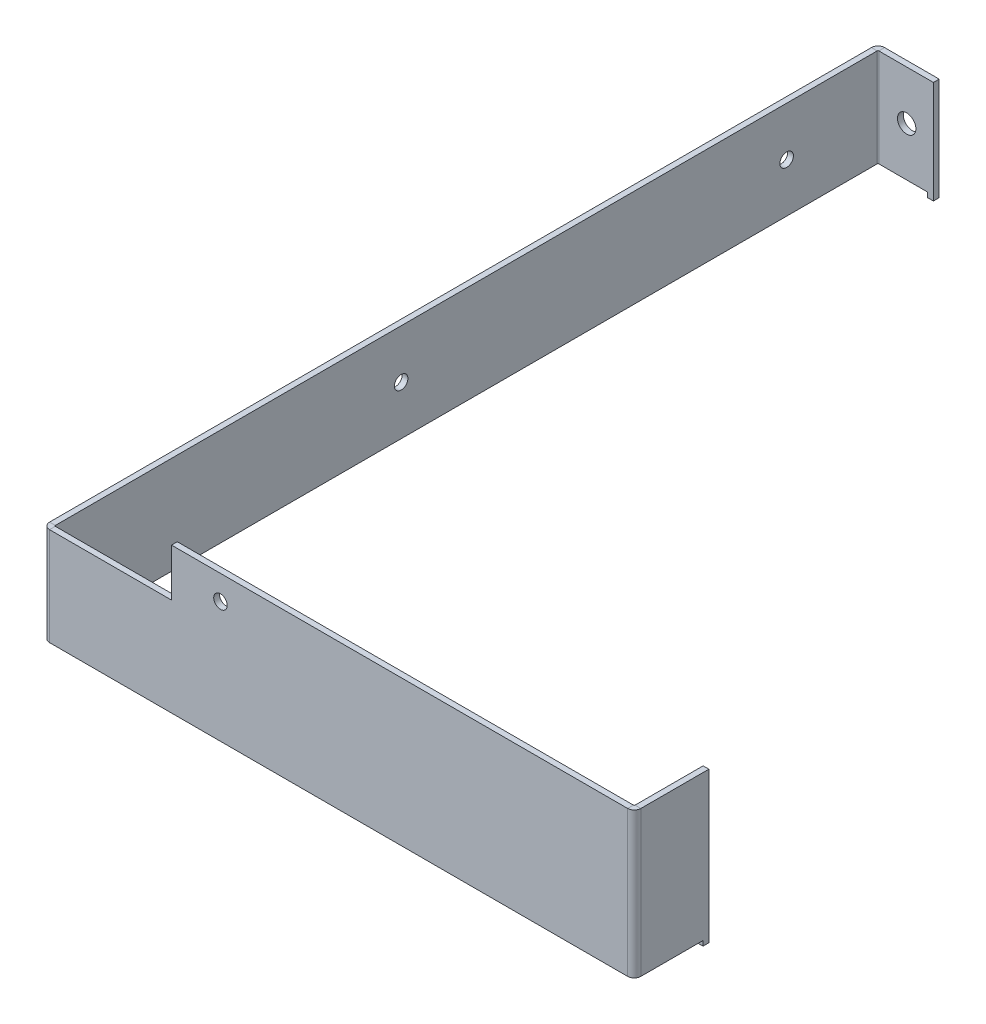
ISO-10303-21;
HEADER;
FILE_DESCRIPTION(('STEP AP214'),'2;1');
FILE_NAME('part.step','',(''),(''),'','','');
FILE_SCHEMA(('AUTOMOTIVE_DESIGN { 1 0 10303 214 1 1 1 1 }'));
ENDSEC;
DATA;
#1=APPLICATION_CONTEXT('core data for automotive mechanical design processes');
#2=APPLICATION_PROTOCOL_DEFINITION('international standard','automotive_design',2000,#1);
#3=PRODUCT_CONTEXT('',#1,'mechanical');
#4=PRODUCT('Part','Part','',(#3));
#5=PRODUCT_RELATED_PRODUCT_CATEGORY('part','',(#4));
#6=PRODUCT_DEFINITION_FORMATION('','',#4);
#7=PRODUCT_DEFINITION_CONTEXT('part definition',#1,'design');
#8=PRODUCT_DEFINITION('design','',#6,#7);
#9=PRODUCT_DEFINITION_SHAPE('','',#8);
#10=(LENGTH_UNIT() NAMED_UNIT(*) SI_UNIT(.MILLI.,.METRE.));
#11=(NAMED_UNIT(*) PLANE_ANGLE_UNIT() SI_UNIT($,.RADIAN.));
#12=(NAMED_UNIT(*) SI_UNIT($,.STERADIAN.) SOLID_ANGLE_UNIT());
#13=UNCERTAINTY_MEASURE_WITH_UNIT(LENGTH_MEASURE(1.E-05),#10,'distance_accuracy_value','');
#14=(GEOMETRIC_REPRESENTATION_CONTEXT(3) GLOBAL_UNCERTAINTY_ASSIGNED_CONTEXT((#13)) GLOBAL_UNIT_ASSIGNED_CONTEXT((#10,
#11,#12)) REPRESENTATION_CONTEXT('',''));
#15=CARTESIAN_POINT('',(0.,0.,0.));
#16=DIRECTION('',(0.,0.,1.));
#17=DIRECTION('',(1.,0.,0.));
#18=AXIS2_PLACEMENT_3D('',#15,#16,#17);
#19=CARTESIAN_POINT('',(-15.8764,0.,-15.0396));
#20=DIRECTION('',(-1.,0.,0.));
#21=DIRECTION('',(0.,0.,1.));
#22=AXIS2_PLACEMENT_3D('',#19,#20,#21);
#23=PLANE('',#22);
#24=CARTESIAN_POINT('',(-15.8763999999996,27.94,123.7841));
#25=DIRECTION('',(1.,0.,0.));
#26=DIRECTION('',(0.,0.,-1.));
#27=AXIS2_PLACEMENT_3D('',#24,#25,#26);
#28=CIRCLE('',#27,1.7526);
#29=CARTESIAN_POINT('',(-15.8763999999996,27.94,122.0315));
#30=VERTEX_POINT('',#29);
#31=EDGE_CURVE('E257',#30,#30,#28,.T.);
#32=ORIENTED_EDGE('',*,*,#31,.T.);
#33=EDGE_LOOP('',(#32));
#34=FACE_BOUND('',#33,.T.);
#35=CARTESIAN_POINT('',(-15.8763999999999,27.94,23.7080999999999));
#36=DIRECTION('',(1.,0.,0.));
#37=DIRECTION('',(0.,0.,-1.));
#38=AXIS2_PLACEMENT_3D('',#35,#36,#37);
#39=CIRCLE('',#38,1.75259999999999);
#40=CARTESIAN_POINT('',(-15.8763999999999,27.94,21.9555));
#41=VERTEX_POINT('',#40);
#42=EDGE_CURVE('E261',#41,#41,#39,.T.);
#43=ORIENTED_EDGE('',*,*,#42,.T.);
#44=EDGE_LOOP('',(#43));
#45=FACE_BOUND('',#44,.T.);
#46=DIRECTION('',(0.,0.,1.));
#47=VECTOR('',#46,1.);
#48=CARTESIAN_POINT('',(-15.8763999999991,40.64,246.301));
#49=LINE('',#48,#47);
#50=CARTESIAN_POINT('',(-15.8764,40.64,0.203199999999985));
#51=VERTEX_POINT('',#50);
#52=CARTESIAN_POINT('',(-15.8763999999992,40.64,213.5618));
#53=VERTEX_POINT('',#52);
#54=EDGE_CURVE('E260',#51,#53,#49,.T.);
#55=ORIENTED_EDGE('',*,*,#54,.F.);
#56=DIRECTION('',(0.,-1.,0.));
#57=VECTOR('',#56,1.);
#58=CARTESIAN_POINT('',(-15.8764,0.,0.203200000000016));
#59=LINE('',#58,#57);
#60=CARTESIAN_POINT('',(-15.8764,15.24,0.203200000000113));
#61=VERTEX_POINT('',#60);
#62=EDGE_CURVE('E371',#51,#61,#59,.T.);
#63=ORIENTED_EDGE('',*,*,#62,.T.);
#64=DIRECTION('',(0.,0.,1.));
#65=VECTOR('',#64,1.);
#66=CARTESIAN_POINT('',(-15.8763999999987,15.24,381.937));
#67=LINE('',#66,#65);
#68=CARTESIAN_POINT('',(-15.8763999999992,15.24,213.5618));
#69=VERTEX_POINT('',#68);
#70=EDGE_CURVE('E264',#61,#69,#67,.T.);
#71=ORIENTED_EDGE('',*,*,#70,.T.);
#72=DIRECTION('',(0.,-1.,0.));
#73=VECTOR('',#72,1.);
#74=CARTESIAN_POINT('',(-15.8763999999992,0.,213.5618));
#75=LINE('',#74,#73);
#76=EDGE_CURVE('E241',#53,#69,#75,.T.);
#77=ORIENTED_EDGE('',*,*,#76,.F.);
#78=EDGE_LOOP('',(#55,#63,#71,#77));
#79=FACE_BOUND('',#78,.T.);
#80=ADVANCED_FACE('F50',(#34,#45,#79),#23,.T.);
#81=CARTESIAN_POINT('',(-15.8763999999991,40.64,246.301));
#82=DIRECTION('',(0.,1.,0.));
#83=DIRECTION('',(1.,0.,0.));
#84=AXIS2_PLACEMENT_3D('',#81,#82,#83);
#85=PLANE('',#84);
#86=DIRECTION('',(0.,0.,1.));
#87=VECTOR('',#86,1.);
#88=CARTESIAN_POINT('',(-14.3763999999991,40.64,246.301));
#89=LINE('',#88,#87);
#90=CARTESIAN_POINT('',(-14.3764,40.64,0.203200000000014));
#91=VERTEX_POINT('',#90);
#92=CARTESIAN_POINT('',(-14.3763999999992,40.64,213.5618));
#93=VERTEX_POINT('',#92);
#94=EDGE_CURVE('E256',#91,#93,#89,.T.);
#95=ORIENTED_EDGE('',*,*,#94,.F.);
#96=DIRECTION('',(-1.,0.,0.));
#97=VECTOR('',#96,1.);
#98=CARTESIAN_POINT('',(-15.8764,40.64,0.203200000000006));
#99=LINE('',#98,#97);
#100=EDGE_CURVE('E378',#91,#51,#99,.T.);
#101=ORIENTED_EDGE('',*,*,#100,.T.);
#102=ORIENTED_EDGE('',*,*,#54,.T.);
#103=DIRECTION('',(-1.,0.,0.));
#104=VECTOR('',#103,1.);
#105=CARTESIAN_POINT('',(-15.8763999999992,40.64,213.5618));
#106=LINE('',#105,#104);
#107=EDGE_CURVE('E271',#93,#53,#106,.T.);
#108=ORIENTED_EDGE('',*,*,#107,.F.);
#109=EDGE_LOOP('',(#95,#101,#102,#108));
#110=FACE_BOUND('',#109,.T.);
#111=ADVANCED_FACE('F481',(#110),#85,.T.);
#112=CARTESIAN_POINT('',(-14.3764,0.,-15.0396));
#113=DIRECTION('',(-1.,0.,0.));
#114=DIRECTION('',(0.,0.,1.));
#115=AXIS2_PLACEMENT_3D('',#112,#113,#114);
#116=PLANE('',#115);
#117=DIRECTION('',(0.,-1.,0.));
#118=VECTOR('',#117,1.);
#119=CARTESIAN_POINT('',(-14.3764,0.,0.203200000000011));
#120=LINE('',#119,#118);
#121=CARTESIAN_POINT('',(-14.3764,15.24,0.203200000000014));
#122=VERTEX_POINT('',#121);
#123=EDGE_CURVE('E381',#91,#122,#120,.T.);
#124=ORIENTED_EDGE('',*,*,#123,.F.);
#125=ORIENTED_EDGE('',*,*,#94,.T.);
#126=DIRECTION('',(0.,-1.,0.));
#127=VECTOR('',#126,1.);
#128=CARTESIAN_POINT('',(-14.3763999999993,0.,213.5618));
#129=LINE('',#128,#127);
#130=CARTESIAN_POINT('',(-14.3763999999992,15.24,213.5618));
#131=VERTEX_POINT('',#130);
#132=EDGE_CURVE('E253',#93,#131,#129,.T.);
#133=ORIENTED_EDGE('',*,*,#132,.T.);
#134=DIRECTION('',(0.,0.,1.));
#135=VECTOR('',#134,1.);
#136=CARTESIAN_POINT('',(-14.3763999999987,15.24,381.937));
#137=LINE('',#136,#135);
#138=EDGE_CURVE('E252',#122,#131,#137,.T.);
#139=ORIENTED_EDGE('',*,*,#138,.F.);
#140=EDGE_LOOP('',(#124,#125,#133,#139));
#141=FACE_BOUND('',#140,.T.);
#142=CARTESIAN_POINT('',(-14.3763999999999,27.94,23.7080999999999));
#143=DIRECTION('',(1.,0.,0.));
#144=DIRECTION('',(0.,0.,-1.));
#145=AXIS2_PLACEMENT_3D('',#142,#143,#144);
#146=CIRCLE('',#145,1.75259999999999);
#147=CARTESIAN_POINT('',(-14.3763999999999,27.94,21.9555));
#148=VERTEX_POINT('',#147);
#149=EDGE_CURVE('E265',#148,#148,#146,.T.);
#150=ORIENTED_EDGE('',*,*,#149,.F.);
#151=EDGE_LOOP('',(#150));
#152=FACE_BOUND('',#151,.T.);
#153=CARTESIAN_POINT('',(-14.3763999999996,27.94,123.7841));
#154=DIRECTION('',(1.,0.,0.));
#155=DIRECTION('',(0.,0.,-1.));
#156=AXIS2_PLACEMENT_3D('',#153,#154,#155);
#157=CIRCLE('',#156,1.7526);
#158=CARTESIAN_POINT('',(-14.3763999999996,27.94,122.0315));
#159=VERTEX_POINT('',#158);
#160=EDGE_CURVE('E268',#159,#159,#157,.T.);
#161=ORIENTED_EDGE('',*,*,#160,.F.);
#162=EDGE_LOOP('',(#161));
#163=FACE_BOUND('',#162,.T.);
#164=ADVANCED_FACE('F476',(#141,#152,#163),#116,.F.);
#165=CARTESIAN_POINT('',(17.4964000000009,40.64,215.265));
#166=DIRECTION('',(0.,1.,0.));
#167=DIRECTION('',(0.,0.,-1.));
#168=AXIS2_PLACEMENT_3D('',#165,#166,#167);
#169=PLANE('',#168);
#170=DIRECTION('',(1.,0.,0.));
#171=VECTOR('',#170,1.);
#172=CARTESIAN_POINT('',(17.4964000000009,40.64,213.765));
#173=LINE('',#172,#171);
#174=CARTESIAN_POINT('',(-14.1731999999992,40.64,213.765));
#175=VERTEX_POINT('',#174);
#176=CARTESIAN_POINT('',(17.4964000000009,40.64,213.765));
#177=VERTEX_POINT('',#176);
#178=EDGE_CURVE('E295',#175,#177,#173,.T.);
#179=ORIENTED_EDGE('',*,*,#178,.F.);
#180=DIRECTION('',(0.,0.,1.));
#181=VECTOR('',#180,1.);
#182=CARTESIAN_POINT('',(-14.1731999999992,40.64,215.265));
#183=LINE('',#182,#181);
#184=CARTESIAN_POINT('',(-14.1731999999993,40.64,215.265));
#185=VERTEX_POINT('',#184);
#186=EDGE_CURVE('E363',#175,#185,#183,.T.);
#187=ORIENTED_EDGE('',*,*,#186,.T.);
#188=DIRECTION('',(1.,0.,0.));
#189=VECTOR('',#188,1.);
#190=CARTESIAN_POINT('',(17.4964000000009,40.64,215.265));
#191=LINE('',#190,#189);
#192=CARTESIAN_POINT('',(17.4964000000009,40.64,215.265));
#193=VERTEX_POINT('',#192);
#194=EDGE_CURVE('E315',#185,#193,#191,.T.);
#195=ORIENTED_EDGE('',*,*,#194,.T.);
#196=DIRECTION('',(0.,0.,-1.));
#197=VECTOR('',#196,1.);
#198=CARTESIAN_POINT('',(17.4964000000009,40.64,215.265));
#199=LINE('',#198,#197);
#200=EDGE_CURVE('E312',#193,#177,#199,.T.);
#201=ORIENTED_EDGE('',*,*,#200,.T.);
#202=EDGE_LOOP('',(#179,#187,#195,#201));
#203=FACE_BOUND('',#202,.T.);
#204=ADVANCED_FACE('F467',(#203),#169,.T.);
#205=CARTESIAN_POINT('',(-243.844199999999,0.,215.265000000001));
#206=DIRECTION('',(0.,0.,1.));
#207=DIRECTION('',(1.,0.,0.));
#208=AXIS2_PLACEMENT_3D('',#205,#206,#207);
#209=PLANE('',#208);
#210=CARTESIAN_POINT('',(30.1964000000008,46.6535349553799,215.265));
#211=DIRECTION('',(0.,0.,-1.));
#212=DIRECTION('',(-1.,0.,0.));
#213=AXIS2_PLACEMENT_3D('',#210,#211,#212);
#214=CIRCLE('',#213,1.75259999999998);
#215=CARTESIAN_POINT('',(28.4438000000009,46.6535349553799,215.265));
#216=VERTEX_POINT('',#215);
#217=EDGE_CURVE('E303',#216,#216,#214,.T.);
#218=ORIENTED_EDGE('',*,*,#217,.T.);
#219=EDGE_LOOP('',(#218));
#220=FACE_BOUND('',#219,.T.);
#221=ORIENTED_EDGE('',*,*,#194,.F.);
#222=DIRECTION('',(0.,-1.,0.));
#223=VECTOR('',#222,1.);
#224=CARTESIAN_POINT('',(-14.1731999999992,0.,215.265));
#225=LINE('',#224,#223);
#226=CARTESIAN_POINT('',(-14.1731999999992,15.24,215.265));
#227=VERTEX_POINT('',#226);
#228=EDGE_CURVE('E356',#185,#227,#225,.T.);
#229=ORIENTED_EDGE('',*,*,#228,.T.);
#230=DIRECTION('',(1.,0.,0.));
#231=VECTOR('',#230,1.);
#232=CARTESIAN_POINT('',(153.132400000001,15.24,215.264999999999));
#233=LINE('',#232,#231);
#234=CARTESIAN_POINT('',(135.911200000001,15.24,215.264999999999));
#235=VERTEX_POINT('',#234);
#236=EDGE_CURVE('E306',#227,#235,#233,.T.);
#237=ORIENTED_EDGE('',*,*,#236,.T.);
#238=DIRECTION('',(0.,-1.,0.));
#239=VECTOR('',#238,1.);
#240=CARTESIAN_POINT('',(135.911200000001,0.,215.264999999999));
#241=LINE('',#240,#239);
#242=CARTESIAN_POINT('',(135.911200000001,53.0035349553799,215.264999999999));
#243=VERTEX_POINT('',#242);
#244=EDGE_CURVE('E282',#243,#235,#241,.T.);
#245=ORIENTED_EDGE('',*,*,#244,.F.);
#246=DIRECTION('',(1.,0.,0.));
#247=VECTOR('',#246,1.);
#248=CARTESIAN_POINT('',(17.4964000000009,53.00353495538,215.265));
#249=LINE('',#248,#247);
#250=CARTESIAN_POINT('',(17.4964000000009,53.00353495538,215.265));
#251=VERTEX_POINT('',#250);
#252=EDGE_CURVE('E301',#251,#243,#249,.T.);
#253=ORIENTED_EDGE('',*,*,#252,.F.);
#254=DIRECTION('',(0.,1.,0.));
#255=VECTOR('',#254,1.);
#256=CARTESIAN_POINT('',(17.4964000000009,40.64,215.265));
#257=LINE('',#256,#255);
#258=EDGE_CURVE('E309',#193,#251,#257,.T.);
#259=ORIENTED_EDGE('',*,*,#258,.F.);
#260=EDGE_LOOP('',(#221,#229,#237,#245,#253,#259));
#261=FACE_BOUND('',#260,.T.);
#262=ADVANCED_FACE('F408',(#220,#261),#209,.T.);
#263=CARTESIAN_POINT('',(-243.844199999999,0.,213.765000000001));
#264=DIRECTION('',(0.,0.,1.));
#265=DIRECTION('',(1.,0.,0.));
#266=AXIS2_PLACEMENT_3D('',#263,#264,#265);
#267=PLANE('',#266);
#268=DIRECTION('',(0.,-1.,0.));
#269=VECTOR('',#268,1.);
#270=CARTESIAN_POINT('',(-14.1731999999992,0.,213.765));
#271=LINE('',#270,#269);
#272=CARTESIAN_POINT('',(-14.1731999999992,15.24,213.765));
#273=VERTEX_POINT('',#272);
#274=EDGE_CURVE('E366',#175,#273,#271,.T.);
#275=ORIENTED_EDGE('',*,*,#274,.F.);
#276=ORIENTED_EDGE('',*,*,#178,.T.);
#277=DIRECTION('',(0.,1.,0.));
#278=VECTOR('',#277,1.);
#279=CARTESIAN_POINT('',(17.4964000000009,40.64,213.765));
#280=LINE('',#279,#278);
#281=CARTESIAN_POINT('',(17.4964000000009,53.00353495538,213.765));
#282=VERTEX_POINT('',#281);
#283=EDGE_CURVE('E292',#177,#282,#280,.T.);
#284=ORIENTED_EDGE('',*,*,#283,.T.);
#285=DIRECTION('',(1.,0.,0.));
#286=VECTOR('',#285,1.);
#287=CARTESIAN_POINT('',(17.4964000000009,53.00353495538,213.765));
#288=LINE('',#287,#286);
#289=CARTESIAN_POINT('',(135.911200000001,53.0035349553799,213.764999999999));
#290=VERTEX_POINT('',#289);
#291=EDGE_CURVE('E299',#282,#290,#288,.T.);
#292=ORIENTED_EDGE('',*,*,#291,.T.);
#293=DIRECTION('',(0.,-1.,0.));
#294=VECTOR('',#293,1.);
#295=CARTESIAN_POINT('',(135.911200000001,0.,213.764999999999));
#296=LINE('',#295,#294);
#297=CARTESIAN_POINT('',(135.911200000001,15.24,213.764999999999));
#298=VERTEX_POINT('',#297);
#299=EDGE_CURVE('E296',#290,#298,#296,.T.);
#300=ORIENTED_EDGE('',*,*,#299,.T.);
#301=DIRECTION('',(1.,0.,0.));
#302=VECTOR('',#301,1.);
#303=CARTESIAN_POINT('',(153.132400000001,15.24,213.764999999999));
#304=LINE('',#303,#302);
#305=EDGE_CURVE('E291',#273,#298,#304,.T.);
#306=ORIENTED_EDGE('',*,*,#305,.F.);
#307=EDGE_LOOP('',(#275,#276,#284,#292,#300,#306));
#308=FACE_BOUND('',#307,.T.);
#309=CARTESIAN_POINT('',(30.1964000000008,46.6535349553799,213.765));
#310=DIRECTION('',(0.,0.,-1.));
#311=DIRECTION('',(-1.,0.,0.));
#312=AXIS2_PLACEMENT_3D('',#309,#310,#311);
#313=CIRCLE('',#312,1.75259999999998);
#314=CARTESIAN_POINT('',(28.4438000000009,46.6535349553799,213.765));
#315=VERTEX_POINT('',#314);
#316=EDGE_CURVE('E316',#315,#315,#313,.T.);
#317=ORIENTED_EDGE('',*,*,#316,.F.);
#318=EDGE_LOOP('',(#317));
#319=FACE_BOUND('',#318,.T.);
#320=ADVANCED_FACE('F455',(#308,#319),#267,.F.);
#321=CARTESIAN_POINT('',(137.614400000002,53.0035349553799,333.046199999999));
#322=DIRECTION('',(0.,1.,0.));
#323=DIRECTION('',(-1.,0.,0.));
#324=AXIS2_PLACEMENT_3D('',#321,#322,#323);
#325=PLANE('',#324);
#326=DIRECTION('',(0.,0.,-1.));
#327=VECTOR('',#326,1.);
#328=CARTESIAN_POINT('',(136.114400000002,53.0035349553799,333.046199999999));
#329=LINE('',#328,#327);
#330=CARTESIAN_POINT('',(136.114400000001,53.0035349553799,213.561799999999));
#331=VERTEX_POINT('',#330);
#332=CARTESIAN_POINT('',(136.114400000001,53.00353495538,195.886199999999));
#333=VERTEX_POINT('',#332);
#334=EDGE_CURVE('E334',#331,#333,#329,.T.);
#335=ORIENTED_EDGE('',*,*,#334,.F.);
#336=DIRECTION('',(1.,0.,0.));
#337=VECTOR('',#336,1.);
#338=CARTESIAN_POINT('',(137.614400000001,53.0035349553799,213.561799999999));
#339=LINE('',#338,#337);
#340=CARTESIAN_POINT('',(137.614400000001,53.0035349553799,213.561799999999));
#341=VERTEX_POINT('',#340);
#342=EDGE_CURVE('E348',#331,#341,#339,.T.);
#343=ORIENTED_EDGE('',*,*,#342,.T.);
#344=DIRECTION('',(0.,0.,-1.));
#345=VECTOR('',#344,1.);
#346=CARTESIAN_POINT('',(137.614400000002,53.0035349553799,333.046199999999));
#347=LINE('',#346,#345);
#348=CARTESIAN_POINT('',(137.614400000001,53.00353495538,195.886199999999));
#349=VERTEX_POINT('',#348);
#350=EDGE_CURVE('E339',#341,#349,#347,.T.);
#351=ORIENTED_EDGE('',*,*,#350,.T.);
#352=DIRECTION('',(-1.,0.,0.));
#353=VECTOR('',#352,1.);
#354=CARTESIAN_POINT('',(137.614400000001,53.00353495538,195.886199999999));
#355=LINE('',#354,#353);
#356=EDGE_CURVE('E338',#349,#333,#355,.T.);
#357=ORIENTED_EDGE('',*,*,#356,.T.);
#358=EDGE_LOOP('',(#335,#343,#351,#357));
#359=FACE_BOUND('',#358,.T.);
#360=ADVANCED_FACE('F445',(#359),#325,.T.);
#361=CARTESIAN_POINT('',(137.614400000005,-1.30004753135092E-13,594.386799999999));
#362=DIRECTION('',(1.,0.,0.));
#363=DIRECTION('',(0.,0.,-1.));
#364=AXIS2_PLACEMENT_3D('',#361,#362,#363);
#365=PLANE('',#364);
#366=DIRECTION('',(0.,0.,1.));
#367=VECTOR('',#366,1.);
#368=CARTESIAN_POINT('',(137.614400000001,13.9699999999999,-1.5));
#369=LINE('',#368,#367);
#370=CARTESIAN_POINT('',(137.614400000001,13.9699999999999,195.886199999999));
#371=VERTEX_POINT('',#370);
#372=CARTESIAN_POINT('',(137.614400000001,13.9699999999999,197.410199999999));
#373=VERTEX_POINT('',#372);
#374=EDGE_CURVE('E65',#371,#373,#369,.T.);
#375=ORIENTED_EDGE('',*,*,#374,.F.);
#376=DIRECTION('',(0.,-1.,0.));
#377=VECTOR('',#376,1.);
#378=CARTESIAN_POINT('',(137.614400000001,-53.0035349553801,195.886199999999));
#379=LINE('',#378,#377);
#380=EDGE_CURVE('E335',#349,#371,#379,.T.);
#381=ORIENTED_EDGE('',*,*,#380,.F.);
#382=ORIENTED_EDGE('',*,*,#350,.F.);
#383=DIRECTION('',(0.,-1.,0.));
#384=VECTOR('',#383,1.);
#385=CARTESIAN_POINT('',(137.614400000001,0.,213.561799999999));
#386=LINE('',#385,#384);
#387=CARTESIAN_POINT('',(137.614400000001,15.24,213.561799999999));
#388=VERTEX_POINT('',#387);
#389=EDGE_CURVE('E345',#341,#388,#386,.T.);
#390=ORIENTED_EDGE('',*,*,#389,.T.);
#391=DIRECTION('',(0.,0.,-1.));
#392=VECTOR('',#391,1.);
#393=CARTESIAN_POINT('',(137.614400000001,15.24,197.410199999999));
#394=LINE('',#393,#392);
#395=CARTESIAN_POINT('',(137.614400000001,15.24,197.410199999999));
#396=VERTEX_POINT('',#395);
#397=EDGE_CURVE('E327',#388,#396,#394,.T.);
#398=ORIENTED_EDGE('',*,*,#397,.T.);
#399=DIRECTION('',(0.,-1.,0.));
#400=VECTOR('',#399,1.);
#401=CARTESIAN_POINT('',(137.614400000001,12.6999999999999,197.410199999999));
#402=LINE('',#401,#400);
#403=EDGE_CURVE('E324',#396,#373,#402,.T.);
#404=ORIENTED_EDGE('',*,*,#403,.T.);
#405=EDGE_LOOP('',(#375,#381,#382,#390,#398,#404));
#406=FACE_BOUND('',#405,.T.);
#407=ADVANCED_FACE('F427',(#406),#365,.T.);
#408=CARTESIAN_POINT('',(137.614400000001,-53.0035349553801,195.886199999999));
#409=DIRECTION('',(0.,0.,-1.));
#410=DIRECTION('',(-1.,0.,0.));
#411=AXIS2_PLACEMENT_3D('',#408,#409,#410);
#412=PLANE('',#411);
#413=DIRECTION('',(1.,0.,0.));
#414=VECTOR('',#413,1.);
#415=CARTESIAN_POINT('',(137.614400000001,13.9699999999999,195.886199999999));
#416=LINE('',#415,#414);
#417=CARTESIAN_POINT('',(136.114400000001,13.9699999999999,195.886199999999));
#418=VERTEX_POINT('',#417);
#419=EDGE_CURVE('E442',#418,#371,#416,.T.);
#420=ORIENTED_EDGE('',*,*,#419,.F.);
#421=DIRECTION('',(0.,-1.,0.));
#422=VECTOR('',#421,1.);
#423=CARTESIAN_POINT('',(136.114400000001,-53.0035349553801,195.886199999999));
#424=LINE('',#423,#422);
#425=EDGE_CURVE('E340',#333,#418,#424,.T.);
#426=ORIENTED_EDGE('',*,*,#425,.F.);
#427=ORIENTED_EDGE('',*,*,#356,.F.);
#428=ORIENTED_EDGE('',*,*,#380,.T.);
#429=EDGE_LOOP('',(#420,#426,#427,#428));
#430=FACE_BOUND('',#429,.T.);
#431=ADVANCED_FACE('F440',(#430),#412,.T.);
#432=CARTESIAN_POINT('',(136.114400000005,-1.29748642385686E-13,594.386799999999));
#433=DIRECTION('',(1.,0.,0.));
#434=DIRECTION('',(0.,0.,-1.));
#435=AXIS2_PLACEMENT_3D('',#432,#433,#434);
#436=PLANE('',#435);
#437=ORIENTED_EDGE('',*,*,#425,.T.);
#438=DIRECTION('',(0.,0.,1.));
#439=VECTOR('',#438,1.);
#440=CARTESIAN_POINT('',(136.114400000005,13.9699999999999,594.386799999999));
#441=LINE('',#440,#439);
#442=CARTESIAN_POINT('',(136.114400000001,13.9699999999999,197.410199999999));
#443=VERTEX_POINT('',#442);
#444=EDGE_CURVE('E500',#418,#443,#441,.T.);
#445=ORIENTED_EDGE('',*,*,#444,.T.);
#446=DIRECTION('',(0.,-1.,0.));
#447=VECTOR('',#446,1.);
#448=CARTESIAN_POINT('',(136.114400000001,12.6999999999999,197.410199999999));
#449=LINE('',#448,#447);
#450=CARTESIAN_POINT('',(136.114400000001,15.24,197.410199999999));
#451=VERTEX_POINT('',#450);
#452=EDGE_CURVE('E290',#451,#443,#449,.T.);
#453=ORIENTED_EDGE('',*,*,#452,.F.);
#454=DIRECTION('',(0.,0.,-1.));
#455=VECTOR('',#454,1.);
#456=CARTESIAN_POINT('',(136.114400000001,15.24,197.410199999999));
#457=LINE('',#456,#455);
#458=CARTESIAN_POINT('',(136.114400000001,15.24,213.561799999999));
#459=VERTEX_POINT('',#458);
#460=EDGE_CURVE('E328',#459,#451,#457,.T.);
#461=ORIENTED_EDGE('',*,*,#460,.F.);
#462=DIRECTION('',(0.,-1.,0.));
#463=VECTOR('',#462,1.);
#464=CARTESIAN_POINT('',(136.114400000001,0.,213.561799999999));
#465=LINE('',#464,#463);
#466=EDGE_CURVE('E351',#331,#459,#465,.T.);
#467=ORIENTED_EDGE('',*,*,#466,.F.);
#468=ORIENTED_EDGE('',*,*,#334,.T.);
#469=EDGE_LOOP('',(#437,#445,#453,#461,#467,#468));
#470=FACE_BOUND('',#469,.T.);
#471=ADVANCED_FACE('F589',(#470),#436,.F.);
#472=CARTESIAN_POINT('',(137.614400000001,12.6999999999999,197.410199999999));
#473=DIRECTION('',(0.,0.,-1.));
#474=DIRECTION('',(-1.,0.,0.));
#475=AXIS2_PLACEMENT_3D('',#472,#473,#474);
#476=PLANE('',#475);
#477=ORIENTED_EDGE('',*,*,#452,.T.);
#478=DIRECTION('',(1.,0.,0.));
#479=VECTOR('',#478,1.);
#480=CARTESIAN_POINT('',(137.614400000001,13.9699999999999,197.410199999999));
#481=LINE('',#480,#479);
#482=EDGE_CURVE('E435',#443,#373,#481,.T.);
#483=ORIENTED_EDGE('',*,*,#482,.T.);
#484=ORIENTED_EDGE('',*,*,#403,.F.);
#485=DIRECTION('',(-1.,0.,0.));
#486=VECTOR('',#485,1.);
#487=CARTESIAN_POINT('',(137.614400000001,15.24,197.410199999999));
#488=LINE('',#487,#486);
#489=EDGE_CURVE('E331',#396,#451,#488,.T.);
#490=ORIENTED_EDGE('',*,*,#489,.T.);
#491=EDGE_LOOP('',(#477,#483,#484,#490));
#492=FACE_BOUND('',#491,.T.);
#493=ADVANCED_FACE('F434',(#492),#476,.F.);
#494=CARTESIAN_POINT('',(137.614400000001,15.24,197.410199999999));
#495=DIRECTION('',(0.,1.,0.));
#496=DIRECTION('',(-1.,0.,0.));
#497=AXIS2_PLACEMENT_3D('',#494,#495,#496);
#498=PLANE('',#497);
#499=DIRECTION('',(1.,0.,0.));
#500=VECTOR('',#499,1.);
#501=CARTESIAN_POINT('',(137.614400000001,15.24,213.561799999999));
#502=LINE('',#501,#500);
#503=EDGE_CURVE('E353',#459,#388,#502,.T.);
#504=ORIENTED_EDGE('',*,*,#503,.F.);
#505=ORIENTED_EDGE('',*,*,#460,.T.);
#506=ORIENTED_EDGE('',*,*,#489,.F.);
#507=ORIENTED_EDGE('',*,*,#397,.F.);
#508=EDGE_LOOP('',(#504,#505,#506,#507));
#509=FACE_BOUND('',#508,.T.);
#510=ADVANCED_FACE('F430',(#509),#498,.F.);
#511=CARTESIAN_POINT('',(30.1964000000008,46.6535349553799,215.265));
#512=DIRECTION('',(0.,0.,-1.));
#513=DIRECTION('',(-1.,0.,0.));
#514=AXIS2_PLACEMENT_3D('',#511,#512,#513);
#515=CYLINDRICAL_SURFACE('',#514,1.75259999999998);
#516=ORIENTED_EDGE('',*,*,#217,.F.);
#517=EDGE_LOOP('',(#516));
#518=FACE_BOUND('',#517,.T.);
#519=ORIENTED_EDGE('',*,*,#316,.T.);
#520=EDGE_LOOP('',(#519));
#521=FACE_BOUND('',#520,.T.);
#522=ADVANCED_FACE('F593',(#518,#521),#515,.F.);
#523=CARTESIAN_POINT('',(17.4964000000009,40.64,215.265));
#524=DIRECTION('',(-1.,0.,0.));
#525=DIRECTION('',(0.,0.,1.));
#526=AXIS2_PLACEMENT_3D('',#523,#524,#525);
#527=PLANE('',#526);
#528=ORIENTED_EDGE('',*,*,#283,.F.);
#529=ORIENTED_EDGE('',*,*,#200,.F.);
#530=ORIENTED_EDGE('',*,*,#258,.T.);
#531=DIRECTION('',(0.,0.,-1.));
#532=VECTOR('',#531,1.);
#533=CARTESIAN_POINT('',(17.4964000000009,53.00353495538,215.265));
#534=LINE('',#533,#532);
#535=EDGE_CURVE('E307',#251,#282,#534,.T.);
#536=ORIENTED_EDGE('',*,*,#535,.T.);
#537=EDGE_LOOP('',(#528,#529,#530,#536));
#538=FACE_BOUND('',#537,.T.);
#539=ADVANCED_FACE('F464',(#538),#527,.T.);
#540=CARTESIAN_POINT('',(17.4964000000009,53.00353495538,215.265));
#541=DIRECTION('',(0.,1.,0.));
#542=DIRECTION('',(0.,0.,-1.));
#543=AXIS2_PLACEMENT_3D('',#540,#541,#542);
#544=PLANE('',#543);
#545=DIRECTION('',(0.,0.,1.));
#546=VECTOR('',#545,1.);
#547=CARTESIAN_POINT('',(135.911200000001,53.0035349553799,215.264999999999));
#548=LINE('',#547,#546);
#549=EDGE_CURVE('E319',#290,#243,#548,.T.);
#550=ORIENTED_EDGE('',*,*,#549,.F.);
#551=ORIENTED_EDGE('',*,*,#291,.F.);
#552=ORIENTED_EDGE('',*,*,#535,.F.);
#553=ORIENTED_EDGE('',*,*,#252,.T.);
#554=EDGE_LOOP('',(#550,#551,#552,#553));
#555=FACE_BOUND('',#554,.T.);
#556=ADVANCED_FACE('F461',(#555),#544,.T.);
#557=CARTESIAN_POINT('',(153.132400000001,15.24,215.264999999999));
#558=DIRECTION('',(0.,1.,0.));
#559=DIRECTION('',(0.,0.,-1.));
#560=AXIS2_PLACEMENT_3D('',#557,#558,#559);
#561=PLANE('',#560);
#562=DIRECTION('',(0.,0.,1.));
#563=VECTOR('',#562,1.);
#564=CARTESIAN_POINT('',(-14.1731999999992,15.24,215.265));
#565=LINE('',#564,#563);
#566=EDGE_CURVE('E368',#273,#227,#565,.T.);
#567=ORIENTED_EDGE('',*,*,#566,.F.);
#568=ORIENTED_EDGE('',*,*,#305,.T.);
#569=DIRECTION('',(0.,0.,1.));
#570=VECTOR('',#569,1.);
#571=CARTESIAN_POINT('',(135.911200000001,15.24,215.264999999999));
#572=LINE('',#571,#570);
#573=EDGE_CURVE('E287',#298,#235,#572,.T.);
#574=ORIENTED_EDGE('',*,*,#573,.T.);
#575=ORIENTED_EDGE('',*,*,#236,.F.);
#576=EDGE_LOOP('',(#567,#568,#574,#575));
#577=FACE_BOUND('',#576,.T.);
#578=ADVANCED_FACE('F411',(#577),#561,.F.);
#579=CARTESIAN_POINT('',(135.911200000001,53.0035349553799,213.561799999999));
#580=DIRECTION('',(0.,1.,0.));
#581=DIRECTION('',(0.,0.,-1.));
#582=AXIS2_PLACEMENT_3D('',#579,#580,#581);
#583=PLANE('',#582);
#584=ORIENTED_EDGE('',*,*,#342,.F.);
#585=CARTESIAN_POINT('',(135.911200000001,53.0035349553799,213.561799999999));
#586=DIRECTION('',(0.,1.,0.));
#587=DIRECTION('',(0.,0.,-1.));
#588=AXIS2_PLACEMENT_3D('',#585,#586,#587);
#589=CIRCLE('',#588,0.2032);
#590=EDGE_CURVE('E251',#331,#290,#589,.F.);
#591=ORIENTED_EDGE('',*,*,#590,.T.);
#592=ORIENTED_EDGE('',*,*,#549,.T.);
#593=CARTESIAN_POINT('',(135.911200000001,53.0035349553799,213.561799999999));
#594=DIRECTION('',(0.,-1.,0.));
#595=DIRECTION('',(0.,0.,-1.));
#596=AXIS2_PLACEMENT_3D('',#593,#594,#595);
#597=CIRCLE('',#596,1.70320000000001);
#598=EDGE_CURVE('E276',#341,#243,#597,.T.);
#599=ORIENTED_EDGE('',*,*,#598,.F.);
#600=EDGE_LOOP('',(#584,#591,#592,#599));
#601=FACE_BOUND('',#600,.T.);
#602=ADVANCED_FACE('F449',(#601),#583,.T.);
#603=CARTESIAN_POINT('',(135.911200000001,15.24,213.561799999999));
#604=DIRECTION('',(0.,-1.,0.));
#605=DIRECTION('',(0.,0.,1.));
#606=AXIS2_PLACEMENT_3D('',#603,#604,#605);
#607=PLANE('',#606);
#608=CARTESIAN_POINT('',(135.911200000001,15.24,213.561799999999));
#609=DIRECTION('',(0.,1.,0.));
#610=DIRECTION('',(0.,0.,-1.));
#611=AXIS2_PLACEMENT_3D('',#608,#609,#610);
#612=CIRCLE('',#611,0.2032);
#613=EDGE_CURVE('E280',#298,#459,#612,.T.);
#614=ORIENTED_EDGE('',*,*,#613,.T.);
#615=ORIENTED_EDGE('',*,*,#503,.T.);
#616=CARTESIAN_POINT('',(135.911200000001,15.24,213.561799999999));
#617=DIRECTION('',(0.,1.,0.));
#618=DIRECTION('',(0.,0.,-1.));
#619=AXIS2_PLACEMENT_3D('',#616,#617,#618);
#620=CIRCLE('',#619,1.70320000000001);
#621=EDGE_CURVE('E279',#235,#388,#620,.T.);
#622=ORIENTED_EDGE('',*,*,#621,.F.);
#623=ORIENTED_EDGE('',*,*,#573,.F.);
#624=EDGE_LOOP('',(#614,#615,#622,#623));
#625=FACE_BOUND('',#624,.T.);
#626=ADVANCED_FACE('F420',(#625),#607,.T.);
#627=CARTESIAN_POINT('',(135.911200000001,-3.68667888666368,213.561799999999));
#628=DIRECTION('',(0.,1.,0.));
#629=DIRECTION('',(0.,0.,-1.));
#630=AXIS2_PLACEMENT_3D('',#627,#628,#629);
#631=CYLINDRICAL_SURFACE('',#630,1.7032);
#632=ORIENTED_EDGE('',*,*,#244,.T.);
#633=ORIENTED_EDGE('',*,*,#621,.T.);
#634=ORIENTED_EDGE('',*,*,#389,.F.);
#635=ORIENTED_EDGE('',*,*,#598,.T.);
#636=EDGE_LOOP('',(#632,#633,#634,#635));
#637=FACE_BOUND('',#636,.T.);
#638=ADVANCED_FACE('F417',(#637),#631,.T.);
#639=CARTESIAN_POINT('',(135.911200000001,-3.68667888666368,213.561799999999));
#640=DIRECTION('',(0.,1.,0.));
#641=DIRECTION('',(0.,0.,-1.));
#642=AXIS2_PLACEMENT_3D('',#639,#640,#641);
#643=CYLINDRICAL_SURFACE('',#642,0.2032);
#644=ORIENTED_EDGE('',*,*,#299,.F.);
#645=ORIENTED_EDGE('',*,*,#590,.F.);
#646=ORIENTED_EDGE('',*,*,#466,.T.);
#647=ORIENTED_EDGE('',*,*,#613,.F.);
#648=EDGE_LOOP('',(#644,#645,#646,#647));
#649=FACE_BOUND('',#648,.T.);
#650=ADVANCED_FACE('F452',(#649),#643,.F.);
#651=CARTESIAN_POINT('',(-15.8763999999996,27.94,123.7841));
#652=DIRECTION('',(1.,0.,0.));
#653=DIRECTION('',(0.,0.,-1.));
#654=AXIS2_PLACEMENT_3D('',#651,#652,#653);
#655=CYLINDRICAL_SURFACE('',#654,1.7526);
#656=ORIENTED_EDGE('',*,*,#31,.F.);
#657=EDGE_LOOP('',(#656));
#658=FACE_BOUND('',#657,.T.);
#659=ORIENTED_EDGE('',*,*,#160,.T.);
#660=EDGE_LOOP('',(#659));
#661=FACE_BOUND('',#660,.T.);
#662=ADVANCED_FACE('F707',(#658,#661),#655,.F.);
#663=CARTESIAN_POINT('',(-15.8763999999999,27.94,23.7080999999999));
#664=DIRECTION('',(1.,0.,0.));
#665=DIRECTION('',(0.,0.,-1.));
#666=AXIS2_PLACEMENT_3D('',#663,#664,#665);
#667=CYLINDRICAL_SURFACE('',#666,1.75259999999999);
#668=ORIENTED_EDGE('',*,*,#42,.F.);
#669=EDGE_LOOP('',(#668));
#670=FACE_BOUND('',#669,.T.);
#671=ORIENTED_EDGE('',*,*,#149,.T.);
#672=EDGE_LOOP('',(#671));
#673=FACE_BOUND('',#672,.T.);
#674=ADVANCED_FACE('F734',(#670,#673),#667,.F.);
#675=CARTESIAN_POINT('',(-15.8763999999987,15.24,381.937));
#676=DIRECTION('',(0.,1.,0.));
#677=DIRECTION('',(1.,0.,0.));
#678=AXIS2_PLACEMENT_3D('',#675,#676,#677);
#679=PLANE('',#678);
#680=DIRECTION('',(-1.,0.,0.));
#681=VECTOR('',#680,1.);
#682=CARTESIAN_POINT('',(-15.8764,15.24,0.203200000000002));
#683=LINE('',#682,#681);
#684=EDGE_CURVE('E58',#122,#61,#683,.T.);
#685=ORIENTED_EDGE('',*,*,#684,.F.);
#686=ORIENTED_EDGE('',*,*,#138,.T.);
#687=DIRECTION('',(-1.,0.,0.));
#688=VECTOR('',#687,1.);
#689=CARTESIAN_POINT('',(-15.8763999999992,15.24,213.5618));
#690=LINE('',#689,#688);
#691=EDGE_CURVE('E248',#131,#69,#690,.T.);
#692=ORIENTED_EDGE('',*,*,#691,.T.);
#693=ORIENTED_EDGE('',*,*,#70,.F.);
#694=EDGE_LOOP('',(#685,#686,#692,#693));
#695=FACE_BOUND('',#694,.T.);
#696=ADVANCED_FACE('F52',(#695),#679,.F.);
#697=CARTESIAN_POINT('',(-14.1731999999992,40.64,213.5618));
#698=DIRECTION('',(0.,1.,0.));
#699=DIRECTION('',(1.,0.,0.));
#700=AXIS2_PLACEMENT_3D('',#697,#698,#699);
#701=PLANE('',#700);
#702=ORIENTED_EDGE('',*,*,#186,.F.);
#703=CARTESIAN_POINT('',(-14.1731999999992,40.64,213.5618));
#704=DIRECTION('',(0.,1.,0.));
#705=DIRECTION('',(1.,0.,0.));
#706=AXIS2_PLACEMENT_3D('',#703,#704,#705);
#707=CIRCLE('',#706,0.2032);
#708=EDGE_CURVE('E242',#175,#93,#707,.F.);
#709=ORIENTED_EDGE('',*,*,#708,.T.);
#710=ORIENTED_EDGE('',*,*,#107,.T.);
#711=CARTESIAN_POINT('',(-14.1731999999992,40.64,213.5618));
#712=DIRECTION('',(0.,-1.,0.));
#713=DIRECTION('',(1.,0.,0.));
#714=AXIS2_PLACEMENT_3D('',#711,#712,#713);
#715=CIRCLE('',#714,1.70319999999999);
#716=EDGE_CURVE('E235',#185,#53,#715,.T.);
#717=ORIENTED_EDGE('',*,*,#716,.F.);
#718=EDGE_LOOP('',(#702,#709,#710,#717));
#719=FACE_BOUND('',#718,.T.);
#720=ADVANCED_FACE('F470',(#719),#701,.T.);
#721=CARTESIAN_POINT('',(-14.1731999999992,15.24,213.5618));
#722=DIRECTION('',(0.,-1.,0.));
#723=DIRECTION('',(-1.,0.,0.));
#724=AXIS2_PLACEMENT_3D('',#721,#722,#723);
#725=PLANE('',#724);
#726=CARTESIAN_POINT('',(-14.1731999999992,15.24,213.5618));
#727=DIRECTION('',(0.,1.,0.));
#728=DIRECTION('',(1.,0.,0.));
#729=AXIS2_PLACEMENT_3D('',#726,#727,#728);
#730=CIRCLE('',#729,0.2032);
#731=EDGE_CURVE('E239',#131,#273,#730,.T.);
#732=ORIENTED_EDGE('',*,*,#731,.T.);
#733=ORIENTED_EDGE('',*,*,#566,.T.);
#734=CARTESIAN_POINT('',(-14.1731999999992,15.24,213.5618));
#735=DIRECTION('',(0.,1.,0.));
#736=DIRECTION('',(1.,0.,0.));
#737=AXIS2_PLACEMENT_3D('',#734,#735,#736);
#738=CIRCLE('',#737,1.70319999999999);
#739=EDGE_CURVE('E238',#69,#227,#738,.T.);
#740=ORIENTED_EDGE('',*,*,#739,.F.);
#741=ORIENTED_EDGE('',*,*,#691,.F.);
#742=EDGE_LOOP('',(#732,#733,#740,#741));
#743=FACE_BOUND('',#742,.T.);
#744=ADVANCED_FACE('F401',(#743),#725,.T.);
#745=CARTESIAN_POINT('',(-14.1731999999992,2.47327574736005,213.5618));
#746=DIRECTION('',(0.,1.,0.));
#747=DIRECTION('',(1.,0.,0.));
#748=AXIS2_PLACEMENT_3D('',#745,#746,#747);
#749=CYLINDRICAL_SURFACE('',#748,1.7032);
#750=ORIENTED_EDGE('',*,*,#76,.T.);
#751=ORIENTED_EDGE('',*,*,#739,.T.);
#752=ORIENTED_EDGE('',*,*,#228,.F.);
#753=ORIENTED_EDGE('',*,*,#716,.T.);
#754=EDGE_LOOP('',(#750,#751,#752,#753));
#755=FACE_BOUND('',#754,.T.);
#756=ADVANCED_FACE('F399',(#755),#749,.T.);
#757=CARTESIAN_POINT('',(-14.1731999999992,2.47327574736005,213.5618));
#758=DIRECTION('',(0.,1.,0.));
#759=DIRECTION('',(1.,0.,0.));
#760=AXIS2_PLACEMENT_3D('',#757,#758,#759);
#761=CYLINDRICAL_SURFACE('',#760,0.2032);
#762=ORIENTED_EDGE('',*,*,#132,.F.);
#763=ORIENTED_EDGE('',*,*,#708,.F.);
#764=ORIENTED_EDGE('',*,*,#274,.T.);
#765=ORIENTED_EDGE('',*,*,#731,.F.);
#766=EDGE_LOOP('',(#762,#763,#764,#765));
#767=FACE_BOUND('',#766,.T.);
#768=ADVANCED_FACE('F473',(#767),#761,.F.);
#769=CARTESIAN_POINT('',(-6.93391241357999,27.94,-1.5));
#770=DIRECTION('',(0.,0.,1.));
#771=DIRECTION('',(1.,0.,0.));
#772=AXIS2_PLACEMENT_3D('',#769,#770,#771);
#773=CYLINDRICAL_SURFACE('',#772,2.38760000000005);
#774=CARTESIAN_POINT('',(-6.93391241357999,27.94,-1.5));
#775=DIRECTION('',(0.,0.,1.));
#776=DIRECTION('',(1.,0.,0.));
#777=AXIS2_PLACEMENT_3D('',#774,#775,#776);
#778=CIRCLE('',#777,2.38760000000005);
#779=CARTESIAN_POINT('',(-4.54631241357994,27.94,-1.5));
#780=VERTEX_POINT('',#779);
#781=EDGE_CURVE('E517',#780,#780,#778,.T.);
#782=ORIENTED_EDGE('',*,*,#781,.F.);
#783=EDGE_LOOP('',(#782));
#784=FACE_BOUND('',#783,.T.);
#785=CARTESIAN_POINT('',(-6.93391241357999,27.94,0.));
#786=DIRECTION('',(0.,0.,1.));
#787=DIRECTION('',(1.,0.,0.));
#788=AXIS2_PLACEMENT_3D('',#785,#786,#787);
#789=CIRCLE('',#788,2.38760000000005);
#790=CARTESIAN_POINT('',(-4.54631241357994,27.94,0.));
#791=VERTEX_POINT('',#790);
#792=EDGE_CURVE('E222',#791,#791,#789,.T.);
#793=ORIENTED_EDGE('',*,*,#792,.T.);
#794=EDGE_LOOP('',(#793));
#795=FACE_BOUND('',#794,.T.);
#796=ADVANCED_FACE('F782',(#784,#795),#773,.F.);
#797=CARTESIAN_POINT('',(-1.52399999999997,12.7,-1.5));
#798=DIRECTION('',(1.,0.,0.));
#799=DIRECTION('',(0.,0.,-1.));
#800=AXIS2_PLACEMENT_3D('',#797,#798,#799);
#801=PLANE('',#800);
#802=DIRECTION('',(0.,1.,0.));
#803=VECTOR('',#802,1.);
#804=CARTESIAN_POINT('',(-1.52399999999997,12.7,-1.5));
#805=LINE('',#804,#803);
#806=CARTESIAN_POINT('',(-1.52399999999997,13.9699999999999,-1.5));
#807=VERTEX_POINT('',#806);
#808=CARTESIAN_POINT('',(-1.52399999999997,15.24,-1.5));
#809=VERTEX_POINT('',#808);
#810=EDGE_CURVE('E220',#807,#809,#805,.T.);
#811=ORIENTED_EDGE('',*,*,#810,.F.);
#812=DIRECTION('',(0.,0.,1.));
#813=VECTOR('',#812,1.);
#814=CARTESIAN_POINT('',(-1.52399999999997,13.9699999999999,-1.5));
#815=LINE('',#814,#813);
#816=CARTESIAN_POINT('',(-1.52399999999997,13.9699999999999,0.));
#817=VERTEX_POINT('',#816);
#818=EDGE_CURVE('E199',#807,#817,#815,.T.);
#819=ORIENTED_EDGE('',*,*,#818,.T.);
#820=DIRECTION('',(0.,1.,0.));
#821=VECTOR('',#820,1.);
#822=CARTESIAN_POINT('',(-1.52399999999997,12.7,0.));
#823=LINE('',#822,#821);
#824=CARTESIAN_POINT('',(-1.52399999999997,15.24,0.));
#825=VERTEX_POINT('',#824);
#826=EDGE_CURVE('E218',#817,#825,#823,.T.);
#827=ORIENTED_EDGE('',*,*,#826,.T.);
#828=DIRECTION('',(0.,0.,1.));
#829=VECTOR('',#828,1.);
#830=CARTESIAN_POINT('',(-1.52399999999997,15.24,-1.5));
#831=LINE('',#830,#829);
#832=EDGE_CURVE('E245',#809,#825,#831,.T.);
#833=ORIENTED_EDGE('',*,*,#832,.F.);
#834=EDGE_LOOP('',(#811,#819,#827,#833));
#835=FACE_BOUND('',#834,.T.);
#836=ADVANCED_FACE('F524',(#835),#801,.F.);
#837=CARTESIAN_POINT('',(0.,-40.64,-1.5));
#838=DIRECTION('',(1.,0.,0.));
#839=DIRECTION('',(0.,0.,-1.));
#840=AXIS2_PLACEMENT_3D('',#837,#838,#839);
#841=PLANE('',#840);
#842=DIRECTION('',(0.,0.,1.));
#843=VECTOR('',#842,1.);
#844=CARTESIAN_POINT('',(0.,13.9699999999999,-1.5));
#845=LINE('',#844,#843);
#846=CARTESIAN_POINT('',(0.,13.9699999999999,-1.5));
#847=VERTEX_POINT('',#846);
#848=CARTESIAN_POINT('',(0.,13.9699999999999,0.));
#849=VERTEX_POINT('',#848);
#850=EDGE_CURVE('E73',#847,#849,#845,.T.);
#851=ORIENTED_EDGE('',*,*,#850,.F.);
#852=DIRECTION('',(0.,1.,0.));
#853=VECTOR('',#852,1.);
#854=CARTESIAN_POINT('',(0.,-40.64,-1.5));
#855=LINE('',#854,#853);
#856=CARTESIAN_POINT('',(0.,40.64,-1.5));
#857=VERTEX_POINT('',#856);
#858=EDGE_CURVE('E208',#847,#857,#855,.T.);
#859=ORIENTED_EDGE('',*,*,#858,.T.);
#860=DIRECTION('',(0.,0.,1.));
#861=VECTOR('',#860,1.);
#862=CARTESIAN_POINT('',(0.,40.64,-1.5));
#863=LINE('',#862,#861);
#864=CARTESIAN_POINT('',(0.,40.64,0.));
#865=VERTEX_POINT('',#864);
#866=EDGE_CURVE('E217',#857,#865,#863,.T.);
#867=ORIENTED_EDGE('',*,*,#866,.T.);
#868=DIRECTION('',(0.,1.,0.));
#869=VECTOR('',#868,1.);
#870=CARTESIAN_POINT('',(0.,-40.64,0.));
#871=LINE('',#870,#869);
#872=EDGE_CURVE('E210',#849,#865,#871,.T.);
#873=ORIENTED_EDGE('',*,*,#872,.F.);
#874=EDGE_LOOP('',(#851,#859,#867,#873));
#875=FACE_BOUND('',#874,.T.);
#876=ADVANCED_FACE('F206',(#875),#841,.T.);
#877=CARTESIAN_POINT('',(0.,0.,-1.5));
#878=DIRECTION('',(0.,0.,-1.));
#879=DIRECTION('',(-1.,0.,0.));
#880=AXIS2_PLACEMENT_3D('',#877,#878,#879);
#881=PLANE('',#880);
#882=DIRECTION('',(-1.,0.,0.));
#883=VECTOR('',#882,1.);
#884=CARTESIAN_POINT('',(-15.8763999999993,13.9699999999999,-1.5));
#885=LINE('',#884,#883);
#886=EDGE_CURVE('E196',#847,#807,#885,.T.);
#887=ORIENTED_EDGE('',*,*,#886,.T.);
#888=ORIENTED_EDGE('',*,*,#810,.T.);
#889=DIRECTION('',(-1.,0.,0.));
#890=VECTOR('',#889,1.);
#891=CARTESIAN_POINT('',(-396.9766,15.24,-1.5));
#892=LINE('',#891,#890);
#893=CARTESIAN_POINT('',(-14.1732000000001,15.24,-1.5));
#894=VERTEX_POINT('',#893);
#895=EDGE_CURVE('E520',#809,#894,#892,.T.);
#896=ORIENTED_EDGE('',*,*,#895,.T.);
#897=DIRECTION('',(0.,-1.,0.));
#898=VECTOR('',#897,1.);
#899=CARTESIAN_POINT('',(-14.1732,0.,-1.5));
#900=LINE('',#899,#898);
#901=CARTESIAN_POINT('',(-14.1732,40.64,-1.5));
#902=VERTEX_POINT('',#901);
#903=EDGE_CURVE('E231',#902,#894,#900,.T.);
#904=ORIENTED_EDGE('',*,*,#903,.F.);
#905=DIRECTION('',(-1.,0.,0.));
#906=VECTOR('',#905,1.);
#907=CARTESIAN_POINT('',(-261.3406,40.64,-1.5));
#908=LINE('',#907,#906);
#909=EDGE_CURVE('E216',#857,#902,#908,.T.);
#910=ORIENTED_EDGE('',*,*,#909,.F.);
#911=ORIENTED_EDGE('',*,*,#858,.F.);
#912=EDGE_LOOP('',(#887,#888,#896,#904,#910,#911));
#913=FACE_BOUND('',#912,.T.);
#914=ORIENTED_EDGE('',*,*,#781,.T.);
#915=EDGE_LOOP('',(#914));
#916=FACE_BOUND('',#915,.T.);
#917=ADVANCED_FACE('F213',(#913,#916),#881,.T.);
#918=CARTESIAN_POINT('',(-261.3406,40.64,-1.5));
#919=DIRECTION('',(0.,1.,0.));
#920=DIRECTION('',(0.,0.,1.));
#921=AXIS2_PLACEMENT_3D('',#918,#919,#920);
#922=PLANE('',#921);
#923=DIRECTION('',(0.,0.,-1.));
#924=VECTOR('',#923,1.);
#925=CARTESIAN_POINT('',(-14.1732,40.64,-1.5));
#926=LINE('',#925,#924);
#927=CARTESIAN_POINT('',(-14.1732,40.64,0.));
#928=VERTEX_POINT('',#927);
#929=EDGE_CURVE('E228',#928,#902,#926,.T.);
#930=ORIENTED_EDGE('',*,*,#929,.F.);
#931=DIRECTION('',(-1.,0.,0.));
#932=VECTOR('',#931,1.);
#933=CARTESIAN_POINT('',(-261.3406,40.64,0.));
#934=LINE('',#933,#932);
#935=EDGE_CURVE('E514',#865,#928,#934,.T.);
#936=ORIENTED_EDGE('',*,*,#935,.F.);
#937=ORIENTED_EDGE('',*,*,#866,.F.);
#938=ORIENTED_EDGE('',*,*,#909,.T.);
#939=EDGE_LOOP('',(#930,#936,#937,#938));
#940=FACE_BOUND('',#939,.T.);
#941=ADVANCED_FACE('F544',(#940),#922,.T.);
#942=CARTESIAN_POINT('',(0.,0.,0.));
#943=DIRECTION('',(0.,0.,-1.));
#944=DIRECTION('',(-1.,0.,0.));
#945=AXIS2_PLACEMENT_3D('',#942,#943,#944);
#946=PLANE('',#945);
#947=ORIENTED_EDGE('',*,*,#792,.F.);
#948=EDGE_LOOP('',(#947));
#949=FACE_BOUND('',#948,.T.);
#950=ORIENTED_EDGE('',*,*,#826,.F.);
#951=DIRECTION('',(1.,0.,0.));
#952=VECTOR('',#951,1.);
#953=CARTESIAN_POINT('',(0.,13.9699999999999,0.));
#954=LINE('',#953,#952);
#955=EDGE_CURVE('E12',#817,#849,#954,.T.);
#956=ORIENTED_EDGE('',*,*,#955,.T.);
#957=ORIENTED_EDGE('',*,*,#872,.T.);
#958=ORIENTED_EDGE('',*,*,#935,.T.);
#959=DIRECTION('',(0.,-1.,0.));
#960=VECTOR('',#959,1.);
#961=CARTESIAN_POINT('',(-14.1732,0.,0.));
#962=LINE('',#961,#960);
#963=CARTESIAN_POINT('',(-14.1732000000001,15.24,0.));
#964=VERTEX_POINT('',#963);
#965=EDGE_CURVE('E496',#928,#964,#962,.T.);
#966=ORIENTED_EDGE('',*,*,#965,.T.);
#967=DIRECTION('',(-1.,0.,0.));
#968=VECTOR('',#967,1.);
#969=CARTESIAN_POINT('',(-396.9766,15.24,0.));
#970=LINE('',#969,#968);
#971=EDGE_CURVE('E510',#825,#964,#970,.T.);
#972=ORIENTED_EDGE('',*,*,#971,.F.);
#973=EDGE_LOOP('',(#950,#956,#957,#958,#966,#972));
#974=FACE_BOUND('',#973,.T.);
#975=ADVANCED_FACE('F540',(#949,#974),#946,.F.);
#976=CARTESIAN_POINT('',(-396.9766,15.24,-1.5));
#977=DIRECTION('',(0.,1.,0.));
#978=DIRECTION('',(0.,0.,1.));
#979=AXIS2_PLACEMENT_3D('',#976,#977,#978);
#980=PLANE('',#979);
#981=ORIENTED_EDGE('',*,*,#971,.T.);
#982=DIRECTION('',(0.,0.,-1.));
#983=VECTOR('',#982,1.);
#984=CARTESIAN_POINT('',(-14.1732,15.24,-1.5));
#985=LINE('',#984,#983);
#986=EDGE_CURVE('E507',#964,#894,#985,.T.);
#987=ORIENTED_EDGE('',*,*,#986,.T.);
#988=ORIENTED_EDGE('',*,*,#895,.F.);
#989=ORIENTED_EDGE('',*,*,#832,.T.);
#990=EDGE_LOOP('',(#981,#987,#988,#989));
#991=FACE_BOUND('',#990,.T.);
#992=ADVANCED_FACE('F528',(#991),#980,.F.);
#993=CARTESIAN_POINT('',(-14.1732,40.64,0.2032));
#994=DIRECTION('',(0.,1.,0.));
#995=DIRECTION('',(0.,0.,1.));
#996=AXIS2_PLACEMENT_3D('',#993,#994,#995);
#997=PLANE('',#996);
#998=ORIENTED_EDGE('',*,*,#100,.F.);
#999=CARTESIAN_POINT('',(-14.1732,40.64,0.2032));
#1000=DIRECTION('',(0.,1.,0.));
#1001=DIRECTION('',(-1.,0.,0.));
#1002=AXIS2_PLACEMENT_3D('',#999,#1000,#1001);
#1003=CIRCLE('',#1002,0.2032);
#1004=EDGE_CURVE('E487',#91,#928,#1003,.F.);
#1005=ORIENTED_EDGE('',*,*,#1004,.T.);
#1006=ORIENTED_EDGE('',*,*,#929,.T.);
#1007=CARTESIAN_POINT('',(-14.1732,40.64,0.2032));
#1008=DIRECTION('',(0.,-1.,0.));
#1009=DIRECTION('',(0.,0.,1.));
#1010=AXIS2_PLACEMENT_3D('',#1007,#1008,#1009);
#1011=CIRCLE('',#1010,1.7032);
#1012=EDGE_CURVE('E489',#51,#902,#1011,.T.);
#1013=ORIENTED_EDGE('',*,*,#1012,.F.);
#1014=EDGE_LOOP('',(#998,#1005,#1006,#1013));
#1015=FACE_BOUND('',#1014,.T.);
#1016=ADVANCED_FACE('F486',(#1015),#997,.T.);
#1017=CARTESIAN_POINT('',(-14.1732,15.24,0.2032));
#1018=DIRECTION('',(0.,-1.,0.));
#1019=DIRECTION('',(0.,0.,-1.));
#1020=AXIS2_PLACEMENT_3D('',#1017,#1018,#1019);
#1021=PLANE('',#1020);
#1022=CARTESIAN_POINT('',(-14.1732,15.24,0.2032));
#1023=DIRECTION('',(0.,1.,0.));
#1024=DIRECTION('',(-1.,0.,0.));
#1025=AXIS2_PLACEMENT_3D('',#1022,#1023,#1024);
#1026=CIRCLE('',#1025,0.2032);
#1027=EDGE_CURVE('E497',#964,#122,#1026,.T.);
#1028=ORIENTED_EDGE('',*,*,#1027,.T.);
#1029=ORIENTED_EDGE('',*,*,#684,.T.);
#1030=CARTESIAN_POINT('',(-14.1732,15.24,0.2032));
#1031=DIRECTION('',(0.,1.,0.));
#1032=DIRECTION('',(0.,0.,1.));
#1033=AXIS2_PLACEMENT_3D('',#1030,#1031,#1032);
#1034=CIRCLE('',#1033,1.7032);
#1035=EDGE_CURVE('E234',#894,#61,#1034,.T.);
#1036=ORIENTED_EDGE('',*,*,#1035,.F.);
#1037=ORIENTED_EDGE('',*,*,#986,.F.);
#1038=EDGE_LOOP('',(#1028,#1029,#1036,#1037));
#1039=FACE_BOUND('',#1038,.T.);
#1040=ADVANCED_FACE('F534',(#1039),#1021,.T.);
#1041=CARTESIAN_POINT('',(-14.1732,2.47327574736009,0.2032));
#1042=DIRECTION('',(0.,1.,0.));
#1043=DIRECTION('',(-1.,0.,0.));
#1044=AXIS2_PLACEMENT_3D('',#1041,#1042,#1043);
#1045=CYLINDRICAL_SURFACE('',#1044,1.7032);
#1046=ORIENTED_EDGE('',*,*,#903,.T.);
#1047=ORIENTED_EDGE('',*,*,#1035,.T.);
#1048=ORIENTED_EDGE('',*,*,#62,.F.);
#1049=ORIENTED_EDGE('',*,*,#1012,.T.);
#1050=EDGE_LOOP('',(#1046,#1047,#1048,#1049));
#1051=FACE_BOUND('',#1050,.T.);
#1052=ADVANCED_FACE('F533',(#1051),#1045,.T.);
#1053=CARTESIAN_POINT('',(-14.1732,2.47327574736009,0.2032));
#1054=DIRECTION('',(0.,1.,0.));
#1055=DIRECTION('',(-1.,0.,0.));
#1056=AXIS2_PLACEMENT_3D('',#1053,#1054,#1055);
#1057=CYLINDRICAL_SURFACE('',#1056,0.2032);
#1058=ORIENTED_EDGE('',*,*,#965,.F.);
#1059=ORIENTED_EDGE('',*,*,#1004,.F.);
#1060=ORIENTED_EDGE('',*,*,#123,.T.);
#1061=ORIENTED_EDGE('',*,*,#1027,.F.);
#1062=EDGE_LOOP('',(#1058,#1059,#1060,#1061));
#1063=FACE_BOUND('',#1062,.T.);
#1064=ADVANCED_FACE('F492',(#1063),#1057,.F.);
#1065=CARTESIAN_POINT('',(-15.8763999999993,13.9699999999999,-1.5));
#1066=DIRECTION('',(0.,1.,0.));
#1067=DIRECTION('',(0.,0.,1.));
#1068=AXIS2_PLACEMENT_3D('',#1065,#1066,#1067);
#1069=PLANE('',#1068);
#1070=ORIENTED_EDGE('',*,*,#886,.F.);
#1071=ORIENTED_EDGE('',*,*,#850,.T.);
#1072=ORIENTED_EDGE('',*,*,#955,.F.);
#1073=ORIENTED_EDGE('',*,*,#818,.F.);
#1074=EDGE_LOOP('',(#1070,#1071,#1072,#1073));
#1075=FACE_BOUND('',#1074,.T.);
#1076=ADVANCED_FACE('F197',(#1075),#1069,.F.);
#1077=ORIENTED_EDGE('',*,*,#419,.T.);
#1078=ORIENTED_EDGE('',*,*,#374,.T.);
#1079=ORIENTED_EDGE('',*,*,#482,.F.);
#1080=ORIENTED_EDGE('',*,*,#444,.F.);
#1081=EDGE_LOOP('',(#1077,#1078,#1079,#1080));
#1082=FACE_BOUND('',#1081,.T.);
#1083=ADVANCED_FACE('F887',(#1082),#1069,.F.);
#1084=CLOSED_SHELL('',(#80,#111,#164,#204,#262,#320,#360,#407,#431,#471,#493,#510,#522,#539,
#556,#578,#602,#626,#638,#650,#662,#674,#696,#720,#744,#756,#768,#796,#836,#876,#917,#941,#975,
#992,#1016,#1040,#1052,#1064,#1076,#1083));
#1085=MANIFOLD_SOLID_BREP('B2',#1084);
#1086=ADVANCED_BREP_SHAPE_REPRESENTATION('',(#18,#1085),#14);
#1087=SHAPE_DEFINITION_REPRESENTATION(#9,#1086);
ENDSEC;
END-ISO-10303-21;
